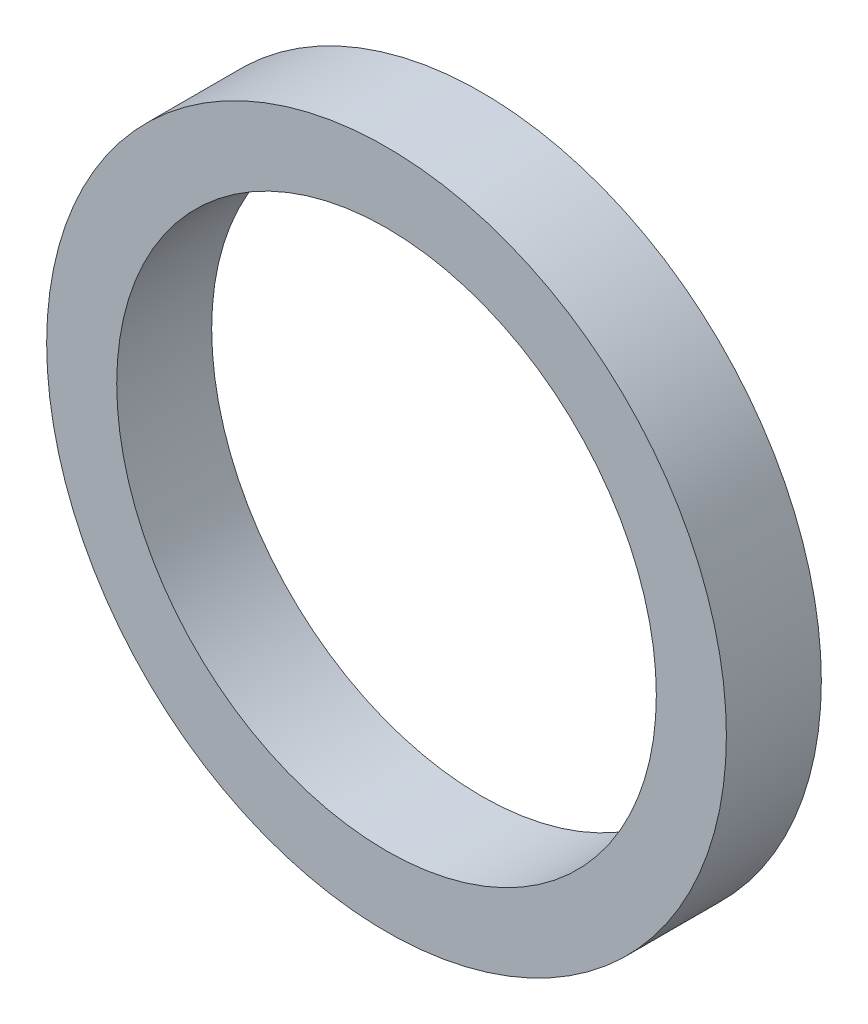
from build123d import *

# Parameters (mm, degrees)
ESQUISSE1_W = 4.1
ESQUISSE1_H = 3.025


with BuildPart() as part:
    # Esquisse1 → R_volution1 (revolve)
    with BuildSketch(Plane(origin=(0, 0, 0), x_dir=(0, 0, -1), z_dir=(1, 0, 0)), mode=Mode.PRIVATE) as r_volution1_sk:
        with Locations((2.05, 13.1625)):
            Rectangle(ESQUISSE1_W, ESQUISSE1_H)
    revolve(r_volution1_sk.sketch.rotate(Axis((0, 0, 0), (0, 0, -1)), 90), axis=Axis((0, 0, 0), (0, 0, -1)))


solid = part.part
